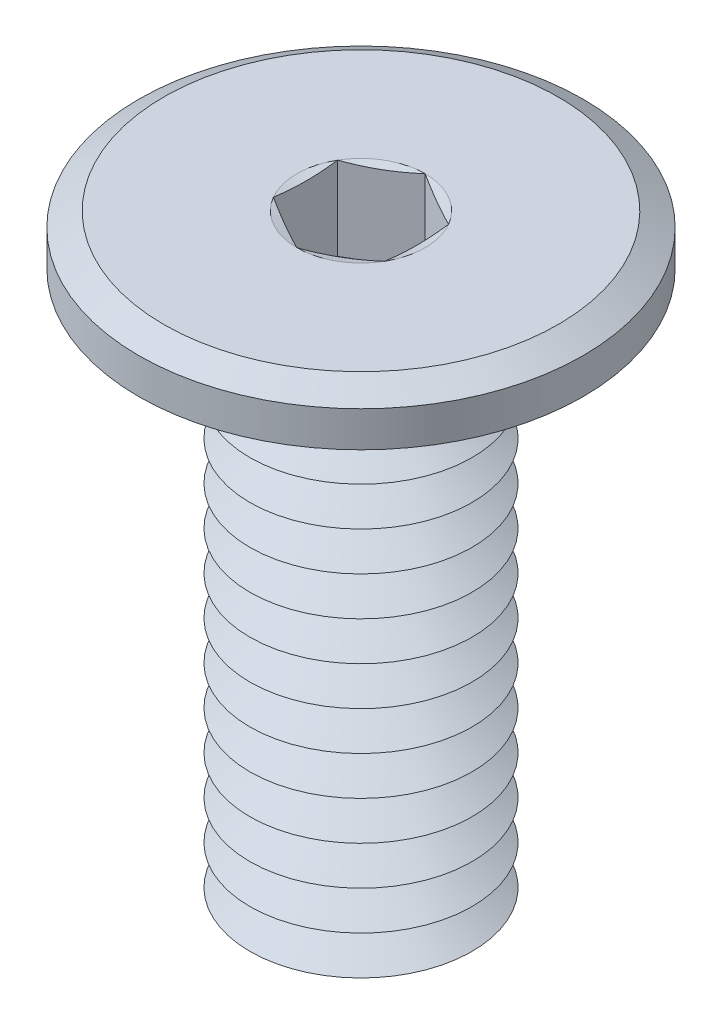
ISO-10303-21;
HEADER;
FILE_DESCRIPTION(('STEP AP214'),'2;1');
FILE_NAME('part.step','',(''),(''),'','','');
FILE_SCHEMA(('AUTOMOTIVE_DESIGN { 1 0 10303 214 1 1 1 1 }'));
ENDSEC;
DATA;
#1=APPLICATION_CONTEXT('core data for automotive mechanical design processes');
#2=APPLICATION_PROTOCOL_DEFINITION('international standard','automotive_design',2000,#1);
#3=PRODUCT_CONTEXT('',#1,'mechanical');
#4=PRODUCT('Part','Part','',(#3));
#5=PRODUCT_RELATED_PRODUCT_CATEGORY('part','',(#4));
#6=PRODUCT_DEFINITION_FORMATION('','',#4);
#7=PRODUCT_DEFINITION_CONTEXT('part definition',#1,'design');
#8=PRODUCT_DEFINITION('design','',#6,#7);
#9=PRODUCT_DEFINITION_SHAPE('','',#8);
#10=(LENGTH_UNIT() NAMED_UNIT(*) SI_UNIT(.MILLI.,.METRE.));
#11=(NAMED_UNIT(*) PLANE_ANGLE_UNIT() SI_UNIT($,.RADIAN.));
#12=(NAMED_UNIT(*) SI_UNIT($,.STERADIAN.) SOLID_ANGLE_UNIT());
#13=UNCERTAINTY_MEASURE_WITH_UNIT(LENGTH_MEASURE(1.E-05),#10,'distance_accuracy_value','');
#14=(GEOMETRIC_REPRESENTATION_CONTEXT(3) GLOBAL_UNCERTAINTY_ASSIGNED_CONTEXT((#13)) GLOBAL_UNIT_ASSIGNED_CONTEXT((#10,
#11,#12)) REPRESENTATION_CONTEXT('',''));
#15=CARTESIAN_POINT('',(0.,0.,0.));
#16=DIRECTION('',(0.,0.,1.));
#17=DIRECTION('',(1.,0.,0.));
#18=AXIS2_PLACEMENT_3D('',#15,#16,#17);
#19=CARTESIAN_POINT('',(0.,-9.85,0.));
#20=DIRECTION('',(0.,-1.,0.));
#21=DIRECTION('',(0.,0.,-1.));
#22=AXIS2_PLACEMENT_3D('',#19,#20,#21);
#23=CONICAL_SURFACE('',#22,2.,1.0471975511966);
#24=CARTESIAN_POINT('',(0.,-9.5,0.));
#25=DIRECTION('',(0.,1.,0.));
#26=DIRECTION('',(0.,0.,1.));
#27=AXIS2_PLACEMENT_3D('',#24,#25,#26);
#28=CIRCLE('',#27,1.39378221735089);
#29=CARTESIAN_POINT('',(0.,-9.5,1.39378221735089));
#30=VERTEX_POINT('',#29);
#31=EDGE_CURVE('E457',#30,#30,#28,.T.);
#32=ORIENTED_EDGE('',*,*,#31,.F.);
#33=EDGE_LOOP('',(#32));
#34=FACE_BOUND('',#33,.T.);
#35=CARTESIAN_POINT('',(0.,-9.85,0.));
#36=DIRECTION('',(0.,1.,0.));
#37=DIRECTION('',(0.,0.,1.));
#38=AXIS2_PLACEMENT_3D('',#35,#36,#37);
#39=CIRCLE('',#38,2.);
#40=CARTESIAN_POINT('',(0.,-9.85,2.));
#41=VERTEX_POINT('',#40);
#42=EDGE_CURVE('E461',#41,#41,#39,.T.);
#43=ORIENTED_EDGE('',*,*,#42,.T.);
#44=EDGE_LOOP('',(#43));
#45=FACE_BOUND('',#44,.T.);
#46=ADVANCED_FACE('F39',(#34,#45),#23,.T.);
#47=CARTESIAN_POINT('',(0.,-9.5,0.));
#48=DIRECTION('',(0.,1.,0.));
#49=DIRECTION('',(0.,0.,1.));
#50=AXIS2_PLACEMENT_3D('',#47,#48,#49);
#51=CONICAL_SURFACE('',#50,1.39378221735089,1.0471975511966);
#52=CARTESIAN_POINT('',(0.,-9.15,0.));
#53=DIRECTION('',(0.,1.,0.));
#54=DIRECTION('',(0.,0.,1.));
#55=AXIS2_PLACEMENT_3D('',#52,#53,#54);
#56=CIRCLE('',#55,2.);
#57=CARTESIAN_POINT('',(0.,-9.15,2.));
#58=VERTEX_POINT('',#57);
#59=EDGE_CURVE('E453',#58,#58,#56,.T.);
#60=ORIENTED_EDGE('',*,*,#59,.F.);
#61=EDGE_LOOP('',(#60));
#62=FACE_BOUND('',#61,.T.);
#63=ORIENTED_EDGE('',*,*,#31,.T.);
#64=EDGE_LOOP('',(#63));
#65=FACE_BOUND('',#64,.T.);
#66=ADVANCED_FACE('F233',(#62,#65),#51,.T.);
#67=CARTESIAN_POINT('',(0.,-10.9,0.));
#68=DIRECTION('',(0.,-1.,0.));
#69=DIRECTION('',(0.,0.,-1.));
#70=AXIS2_PLACEMENT_3D('',#67,#68,#69);
#71=PLANE('',#70);
#72=CARTESIAN_POINT('',(0.,-10.9,0.));
#73=DIRECTION('',(0.,1.,0.));
#74=DIRECTION('',(0.,0.,1.));
#75=AXIS2_PLACEMENT_3D('',#72,#73,#74);
#76=CIRCLE('',#75,1.39378221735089);
#77=CARTESIAN_POINT('',(0.,-10.9,1.39378221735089));
#78=VERTEX_POINT('',#77);
#79=EDGE_CURVE('E300',#78,#78,#76,.T.);
#80=ORIENTED_EDGE('',*,*,#79,.F.);
#81=EDGE_LOOP('',(#80));
#82=FACE_BOUND('',#81,.T.);
#83=ADVANCED_FACE('F239',(#82),#71,.T.);
#84=CARTESIAN_POINT('',(0.,-10.9,0.));
#85=DIRECTION('',(0.,1.,0.));
#86=DIRECTION('',(0.,0.,1.));
#87=AXIS2_PLACEMENT_3D('',#84,#85,#86);
#88=CONICAL_SURFACE('',#87,1.39378221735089,1.0471975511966);
#89=CARTESIAN_POINT('',(0.,-10.55,0.));
#90=DIRECTION('',(0.,1.,0.));
#91=DIRECTION('',(0.,0.,1.));
#92=AXIS2_PLACEMENT_3D('',#89,#90,#91);
#93=CIRCLE('',#92,2.);
#94=CARTESIAN_POINT('',(0.,-10.55,2.));
#95=VERTEX_POINT('',#94);
#96=EDGE_CURVE('E469',#95,#95,#93,.T.);
#97=ORIENTED_EDGE('',*,*,#96,.F.);
#98=EDGE_LOOP('',(#97));
#99=FACE_BOUND('',#98,.T.);
#100=ORIENTED_EDGE('',*,*,#79,.T.);
#101=EDGE_LOOP('',(#100));
#102=FACE_BOUND('',#101,.T.);
#103=ADVANCED_FACE('F254',(#99,#102),#88,.T.);
#104=CARTESIAN_POINT('',(0.,-10.55,0.));
#105=DIRECTION('',(0.,-1.,0.));
#106=DIRECTION('',(0.,0.,-1.));
#107=AXIS2_PLACEMENT_3D('',#104,#105,#106);
#108=CONICAL_SURFACE('',#107,2.,1.0471975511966);
#109=CARTESIAN_POINT('',(0.,-10.2,0.));
#110=DIRECTION('',(0.,1.,0.));
#111=DIRECTION('',(0.,0.,1.));
#112=AXIS2_PLACEMENT_3D('',#109,#110,#111);
#113=CIRCLE('',#112,1.39378221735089);
#114=CARTESIAN_POINT('',(0.,-10.2,1.39378221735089));
#115=VERTEX_POINT('',#114);
#116=EDGE_CURVE('E465',#115,#115,#113,.T.);
#117=ORIENTED_EDGE('',*,*,#116,.F.);
#118=EDGE_LOOP('',(#117));
#119=FACE_BOUND('',#118,.T.);
#120=ORIENTED_EDGE('',*,*,#96,.T.);
#121=EDGE_LOOP('',(#120));
#122=FACE_BOUND('',#121,.T.);
#123=ADVANCED_FACE('F250',(#119,#122),#108,.T.);
#124=CARTESIAN_POINT('',(0.,-10.2,0.));
#125=DIRECTION('',(0.,1.,0.));
#126=DIRECTION('',(0.,0.,1.));
#127=AXIS2_PLACEMENT_3D('',#124,#125,#126);
#128=CONICAL_SURFACE('',#127,1.39378221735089,1.0471975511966);
#129=ORIENTED_EDGE('',*,*,#42,.F.);
#130=EDGE_LOOP('',(#129));
#131=FACE_BOUND('',#130,.T.);
#132=ORIENTED_EDGE('',*,*,#116,.T.);
#133=EDGE_LOOP('',(#132));
#134=FACE_BOUND('',#133,.T.);
#135=ADVANCED_FACE('F246',(#131,#134),#128,.T.);
#136=CARTESIAN_POINT('',(0.,-9.15,0.));
#137=DIRECTION('',(0.,-1.,0.));
#138=DIRECTION('',(0.,0.,-1.));
#139=AXIS2_PLACEMENT_3D('',#136,#137,#138);
#140=CONICAL_SURFACE('',#139,2.,1.0471975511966);
#141=CARTESIAN_POINT('',(0.,-8.8,0.));
#142=DIRECTION('',(0.,1.,0.));
#143=DIRECTION('',(0.,0.,1.));
#144=AXIS2_PLACEMENT_3D('',#141,#142,#143);
#145=CIRCLE('',#144,1.39378221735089);
#146=CARTESIAN_POINT('',(0.,-8.8,1.39378221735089));
#147=VERTEX_POINT('',#146);
#148=EDGE_CURVE('E449',#147,#147,#145,.T.);
#149=ORIENTED_EDGE('',*,*,#148,.F.);
#150=EDGE_LOOP('',(#149));
#151=FACE_BOUND('',#150,.T.);
#152=ORIENTED_EDGE('',*,*,#59,.T.);
#153=EDGE_LOOP('',(#152));
#154=FACE_BOUND('',#153,.T.);
#155=ADVANCED_FACE('F249',(#151,#154),#140,.T.);
#156=CARTESIAN_POINT('',(0.,-8.8,0.));
#157=DIRECTION('',(0.,1.,0.));
#158=DIRECTION('',(0.,0.,1.));
#159=AXIS2_PLACEMENT_3D('',#156,#157,#158);
#160=CONICAL_SURFACE('',#159,1.39378221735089,1.0471975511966);
#161=CARTESIAN_POINT('',(0.,-8.45,0.));
#162=DIRECTION('',(0.,1.,0.));
#163=DIRECTION('',(0.,0.,1.));
#164=AXIS2_PLACEMENT_3D('',#161,#162,#163);
#165=CIRCLE('',#164,2.);
#166=CARTESIAN_POINT('',(0.,-8.45,2.));
#167=VERTEX_POINT('',#166);
#168=EDGE_CURVE('E445',#167,#167,#165,.T.);
#169=ORIENTED_EDGE('',*,*,#168,.F.);
#170=EDGE_LOOP('',(#169));
#171=FACE_BOUND('',#170,.T.);
#172=ORIENTED_EDGE('',*,*,#148,.T.);
#173=EDGE_LOOP('',(#172));
#174=FACE_BOUND('',#173,.T.);
#175=ADVANCED_FACE('F604',(#171,#174),#160,.T.);
#176=CARTESIAN_POINT('',(0.,-8.45,0.));
#177=DIRECTION('',(0.,-1.,0.));
#178=DIRECTION('',(0.,0.,-1.));
#179=AXIS2_PLACEMENT_3D('',#176,#177,#178);
#180=CONICAL_SURFACE('',#179,2.,1.0471975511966);
#181=CARTESIAN_POINT('',(0.,-8.1,0.));
#182=DIRECTION('',(0.,1.,0.));
#183=DIRECTION('',(0.,0.,1.));
#184=AXIS2_PLACEMENT_3D('',#181,#182,#183);
#185=CIRCLE('',#184,1.39378221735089);
#186=CARTESIAN_POINT('',(0.,-8.1,1.39378221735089));
#187=VERTEX_POINT('',#186);
#188=EDGE_CURVE('E441',#187,#187,#185,.T.);
#189=ORIENTED_EDGE('',*,*,#188,.F.);
#190=EDGE_LOOP('',(#189));
#191=FACE_BOUND('',#190,.T.);
#192=ORIENTED_EDGE('',*,*,#168,.T.);
#193=EDGE_LOOP('',(#192));
#194=FACE_BOUND('',#193,.T.);
#195=ADVANCED_FACE('F600',(#191,#194),#180,.T.);
#196=CARTESIAN_POINT('',(0.,-8.1,0.));
#197=DIRECTION('',(0.,1.,0.));
#198=DIRECTION('',(0.,0.,1.));
#199=AXIS2_PLACEMENT_3D('',#196,#197,#198);
#200=CONICAL_SURFACE('',#199,1.39378221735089,1.0471975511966);
#201=CARTESIAN_POINT('',(0.,-7.75,0.));
#202=DIRECTION('',(0.,1.,0.));
#203=DIRECTION('',(0.,0.,1.));
#204=AXIS2_PLACEMENT_3D('',#201,#202,#203);
#205=CIRCLE('',#204,2.);
#206=CARTESIAN_POINT('',(0.,-7.75,2.));
#207=VERTEX_POINT('',#206);
#208=EDGE_CURVE('E437',#207,#207,#205,.T.);
#209=ORIENTED_EDGE('',*,*,#208,.F.);
#210=EDGE_LOOP('',(#209));
#211=FACE_BOUND('',#210,.T.);
#212=ORIENTED_EDGE('',*,*,#188,.T.);
#213=EDGE_LOOP('',(#212));
#214=FACE_BOUND('',#213,.T.);
#215=ADVANCED_FACE('F596',(#211,#214),#200,.T.);
#216=CARTESIAN_POINT('',(0.,-7.75,0.));
#217=DIRECTION('',(0.,-1.,0.));
#218=DIRECTION('',(0.,0.,-1.));
#219=AXIS2_PLACEMENT_3D('',#216,#217,#218);
#220=CONICAL_SURFACE('',#219,2.,1.0471975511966);
#221=CARTESIAN_POINT('',(0.,-7.4,0.));
#222=DIRECTION('',(0.,1.,0.));
#223=DIRECTION('',(0.,0.,1.));
#224=AXIS2_PLACEMENT_3D('',#221,#222,#223);
#225=CIRCLE('',#224,1.39378221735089);
#226=CARTESIAN_POINT('',(0.,-7.4,1.39378221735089));
#227=VERTEX_POINT('',#226);
#228=EDGE_CURVE('E433',#227,#227,#225,.T.);
#229=ORIENTED_EDGE('',*,*,#228,.F.);
#230=EDGE_LOOP('',(#229));
#231=FACE_BOUND('',#230,.T.);
#232=ORIENTED_EDGE('',*,*,#208,.T.);
#233=EDGE_LOOP('',(#232));
#234=FACE_BOUND('',#233,.T.);
#235=ADVANCED_FACE('F592',(#231,#234),#220,.T.);
#236=CARTESIAN_POINT('',(0.,-7.4,0.));
#237=DIRECTION('',(0.,1.,0.));
#238=DIRECTION('',(0.,0.,1.));
#239=AXIS2_PLACEMENT_3D('',#236,#237,#238);
#240=CONICAL_SURFACE('',#239,1.39378221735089,1.0471975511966);
#241=CARTESIAN_POINT('',(0.,-7.05,0.));
#242=DIRECTION('',(0.,1.,0.));
#243=DIRECTION('',(0.,0.,1.));
#244=AXIS2_PLACEMENT_3D('',#241,#242,#243);
#245=CIRCLE('',#244,2.);
#246=CARTESIAN_POINT('',(0.,-7.05,2.));
#247=VERTEX_POINT('',#246);
#248=EDGE_CURVE('E429',#247,#247,#245,.T.);
#249=ORIENTED_EDGE('',*,*,#248,.F.);
#250=EDGE_LOOP('',(#249));
#251=FACE_BOUND('',#250,.T.);
#252=ORIENTED_EDGE('',*,*,#228,.T.);
#253=EDGE_LOOP('',(#252));
#254=FACE_BOUND('',#253,.T.);
#255=ADVANCED_FACE('F588',(#251,#254),#240,.T.);
#256=CARTESIAN_POINT('',(0.,-7.05,0.));
#257=DIRECTION('',(0.,-1.,0.));
#258=DIRECTION('',(0.,0.,-1.));
#259=AXIS2_PLACEMENT_3D('',#256,#257,#258);
#260=CONICAL_SURFACE('',#259,2.,1.0471975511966);
#261=CARTESIAN_POINT('',(0.,-6.7,0.));
#262=DIRECTION('',(0.,1.,0.));
#263=DIRECTION('',(0.,0.,1.));
#264=AXIS2_PLACEMENT_3D('',#261,#262,#263);
#265=CIRCLE('',#264,1.39378221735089);
#266=CARTESIAN_POINT('',(0.,-6.7,1.39378221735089));
#267=VERTEX_POINT('',#266);
#268=EDGE_CURVE('E426',#267,#267,#265,.T.);
#269=ORIENTED_EDGE('',*,*,#268,.F.);
#270=EDGE_LOOP('',(#269));
#271=FACE_BOUND('',#270,.T.);
#272=ORIENTED_EDGE('',*,*,#248,.T.);
#273=EDGE_LOOP('',(#272));
#274=FACE_BOUND('',#273,.T.);
#275=ADVANCED_FACE('F584',(#271,#274),#260,.T.);
#276=CARTESIAN_POINT('',(0.,-6.7,0.));
#277=DIRECTION('',(0.,1.,0.));
#278=DIRECTION('',(0.,0.,1.));
#279=AXIS2_PLACEMENT_3D('',#276,#277,#278);
#280=CONICAL_SURFACE('',#279,1.39378221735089,1.0471975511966);
#281=CARTESIAN_POINT('',(0.,-6.35,0.));
#282=DIRECTION('',(0.,1.,0.));
#283=DIRECTION('',(0.,0.,1.));
#284=AXIS2_PLACEMENT_3D('',#281,#282,#283);
#285=CIRCLE('',#284,2.);
#286=CARTESIAN_POINT('',(0.,-6.35,2.));
#287=VERTEX_POINT('',#286);
#288=EDGE_CURVE('E422',#287,#287,#285,.T.);
#289=ORIENTED_EDGE('',*,*,#288,.F.);
#290=EDGE_LOOP('',(#289));
#291=FACE_BOUND('',#290,.T.);
#292=ORIENTED_EDGE('',*,*,#268,.T.);
#293=EDGE_LOOP('',(#292));
#294=FACE_BOUND('',#293,.T.);
#295=ADVANCED_FACE('F580',(#291,#294),#280,.T.);
#296=CARTESIAN_POINT('',(0.,-6.35,0.));
#297=DIRECTION('',(0.,-1.,0.));
#298=DIRECTION('',(0.,0.,-1.));
#299=AXIS2_PLACEMENT_3D('',#296,#297,#298);
#300=CONICAL_SURFACE('',#299,2.,1.0471975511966);
#301=CARTESIAN_POINT('',(0.,-6.,0.));
#302=DIRECTION('',(0.,1.,0.));
#303=DIRECTION('',(0.,0.,1.));
#304=AXIS2_PLACEMENT_3D('',#301,#302,#303);
#305=CIRCLE('',#304,1.39378221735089);
#306=CARTESIAN_POINT('',(0.,-6.,1.39378221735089));
#307=VERTEX_POINT('',#306);
#308=EDGE_CURVE('E419',#307,#307,#305,.T.);
#309=ORIENTED_EDGE('',*,*,#308,.F.);
#310=EDGE_LOOP('',(#309));
#311=FACE_BOUND('',#310,.T.);
#312=ORIENTED_EDGE('',*,*,#288,.T.);
#313=EDGE_LOOP('',(#312));
#314=FACE_BOUND('',#313,.T.);
#315=ADVANCED_FACE('F576',(#311,#314),#300,.T.);
#316=CARTESIAN_POINT('',(0.,-6.,0.));
#317=DIRECTION('',(0.,1.,0.));
#318=DIRECTION('',(0.,0.,1.));
#319=AXIS2_PLACEMENT_3D('',#316,#317,#318);
#320=CONICAL_SURFACE('',#319,1.39378221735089,1.0471975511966);
#321=CARTESIAN_POINT('',(0.,-5.65,0.));
#322=DIRECTION('',(0.,1.,0.));
#323=DIRECTION('',(0.,0.,1.));
#324=AXIS2_PLACEMENT_3D('',#321,#322,#323);
#325=CIRCLE('',#324,2.);
#326=CARTESIAN_POINT('',(0.,-5.65,2.));
#327=VERTEX_POINT('',#326);
#328=EDGE_CURVE('E416',#327,#327,#325,.T.);
#329=ORIENTED_EDGE('',*,*,#328,.F.);
#330=EDGE_LOOP('',(#329));
#331=FACE_BOUND('',#330,.T.);
#332=ORIENTED_EDGE('',*,*,#308,.T.);
#333=EDGE_LOOP('',(#332));
#334=FACE_BOUND('',#333,.T.);
#335=ADVANCED_FACE('F572',(#331,#334),#320,.T.);
#336=CARTESIAN_POINT('',(0.,-5.65,0.));
#337=DIRECTION('',(0.,-1.,0.));
#338=DIRECTION('',(0.,0.,-1.));
#339=AXIS2_PLACEMENT_3D('',#336,#337,#338);
#340=CONICAL_SURFACE('',#339,2.,1.0471975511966);
#341=CARTESIAN_POINT('',(0.,-5.3,0.));
#342=DIRECTION('',(0.,1.,0.));
#343=DIRECTION('',(0.,0.,1.));
#344=AXIS2_PLACEMENT_3D('',#341,#342,#343);
#345=CIRCLE('',#344,1.39378221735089);
#346=CARTESIAN_POINT('',(0.,-5.3,1.39378221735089));
#347=VERTEX_POINT('',#346);
#348=EDGE_CURVE('E412',#347,#347,#345,.T.);
#349=ORIENTED_EDGE('',*,*,#348,.F.);
#350=EDGE_LOOP('',(#349));
#351=FACE_BOUND('',#350,.T.);
#352=ORIENTED_EDGE('',*,*,#328,.T.);
#353=EDGE_LOOP('',(#352));
#354=FACE_BOUND('',#353,.T.);
#355=ADVANCED_FACE('F568',(#351,#354),#340,.T.);
#356=CARTESIAN_POINT('',(0.,-5.3,0.));
#357=DIRECTION('',(0.,1.,0.));
#358=DIRECTION('',(0.,0.,1.));
#359=AXIS2_PLACEMENT_3D('',#356,#357,#358);
#360=CONICAL_SURFACE('',#359,1.39378221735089,1.0471975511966);
#361=CARTESIAN_POINT('',(0.,-4.95,0.));
#362=DIRECTION('',(0.,1.,0.));
#363=DIRECTION('',(0.,0.,1.));
#364=AXIS2_PLACEMENT_3D('',#361,#362,#363);
#365=CIRCLE('',#364,2.);
#366=CARTESIAN_POINT('',(0.,-4.95,2.));
#367=VERTEX_POINT('',#366);
#368=EDGE_CURVE('E408',#367,#367,#365,.T.);
#369=ORIENTED_EDGE('',*,*,#368,.F.);
#370=EDGE_LOOP('',(#369));
#371=FACE_BOUND('',#370,.T.);
#372=ORIENTED_EDGE('',*,*,#348,.T.);
#373=EDGE_LOOP('',(#372));
#374=FACE_BOUND('',#373,.T.);
#375=ADVANCED_FACE('F564',(#371,#374),#360,.T.);
#376=CARTESIAN_POINT('',(0.,-4.95,0.));
#377=DIRECTION('',(0.,-1.,0.));
#378=DIRECTION('',(0.,0.,-1.));
#379=AXIS2_PLACEMENT_3D('',#376,#377,#378);
#380=CONICAL_SURFACE('',#379,2.,1.0471975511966);
#381=CARTESIAN_POINT('',(0.,-4.6,0.));
#382=DIRECTION('',(0.,1.,0.));
#383=DIRECTION('',(0.,0.,1.));
#384=AXIS2_PLACEMENT_3D('',#381,#382,#383);
#385=CIRCLE('',#384,1.39378221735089);
#386=CARTESIAN_POINT('',(0.,-4.6,1.39378221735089));
#387=VERTEX_POINT('',#386);
#388=EDGE_CURVE('E404',#387,#387,#385,.T.);
#389=ORIENTED_EDGE('',*,*,#388,.F.);
#390=EDGE_LOOP('',(#389));
#391=FACE_BOUND('',#390,.T.);
#392=ORIENTED_EDGE('',*,*,#368,.T.);
#393=EDGE_LOOP('',(#392));
#394=FACE_BOUND('',#393,.T.);
#395=ADVANCED_FACE('F560',(#391,#394),#380,.T.);
#396=CARTESIAN_POINT('',(0.,-4.6,0.));
#397=DIRECTION('',(0.,1.,0.));
#398=DIRECTION('',(0.,0.,1.));
#399=AXIS2_PLACEMENT_3D('',#396,#397,#398);
#400=CONICAL_SURFACE('',#399,1.39378221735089,1.0471975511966);
#401=CARTESIAN_POINT('',(0.,-4.25,0.));
#402=DIRECTION('',(0.,1.,0.));
#403=DIRECTION('',(0.,0.,1.));
#404=AXIS2_PLACEMENT_3D('',#401,#402,#403);
#405=CIRCLE('',#404,2.);
#406=CARTESIAN_POINT('',(0.,-4.25,2.));
#407=VERTEX_POINT('',#406);
#408=EDGE_CURVE('E400',#407,#407,#405,.T.);
#409=ORIENTED_EDGE('',*,*,#408,.F.);
#410=EDGE_LOOP('',(#409));
#411=FACE_BOUND('',#410,.T.);
#412=ORIENTED_EDGE('',*,*,#388,.T.);
#413=EDGE_LOOP('',(#412));
#414=FACE_BOUND('',#413,.T.);
#415=ADVANCED_FACE('F556',(#411,#414),#400,.T.);
#416=CARTESIAN_POINT('',(0.,-4.25,0.));
#417=DIRECTION('',(0.,-1.,0.));
#418=DIRECTION('',(0.,0.,-1.));
#419=AXIS2_PLACEMENT_3D('',#416,#417,#418);
#420=CONICAL_SURFACE('',#419,2.,1.0471975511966);
#421=CARTESIAN_POINT('',(0.,-3.9,0.));
#422=DIRECTION('',(0.,1.,0.));
#423=DIRECTION('',(0.,0.,1.));
#424=AXIS2_PLACEMENT_3D('',#421,#422,#423);
#425=CIRCLE('',#424,1.39378221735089);
#426=CARTESIAN_POINT('',(0.,-3.9,1.39378221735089));
#427=VERTEX_POINT('',#426);
#428=EDGE_CURVE('E396',#427,#427,#425,.T.);
#429=ORIENTED_EDGE('',*,*,#428,.F.);
#430=EDGE_LOOP('',(#429));
#431=FACE_BOUND('',#430,.T.);
#432=ORIENTED_EDGE('',*,*,#408,.T.);
#433=EDGE_LOOP('',(#432));
#434=FACE_BOUND('',#433,.T.);
#435=ADVANCED_FACE('F552',(#431,#434),#420,.T.);
#436=CARTESIAN_POINT('',(0.,-3.9,0.));
#437=DIRECTION('',(0.,1.,0.));
#438=DIRECTION('',(0.,0.,1.));
#439=AXIS2_PLACEMENT_3D('',#436,#437,#438);
#440=CONICAL_SURFACE('',#439,1.39378221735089,1.0471975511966);
#441=CARTESIAN_POINT('',(0.,-3.55,0.));
#442=DIRECTION('',(0.,1.,0.));
#443=DIRECTION('',(0.,0.,1.));
#444=AXIS2_PLACEMENT_3D('',#441,#442,#443);
#445=CIRCLE('',#444,2.);
#446=CARTESIAN_POINT('',(0.,-3.55,2.));
#447=VERTEX_POINT('',#446);
#448=EDGE_CURVE('E392',#447,#447,#445,.T.);
#449=ORIENTED_EDGE('',*,*,#448,.F.);
#450=EDGE_LOOP('',(#449));
#451=FACE_BOUND('',#450,.T.);
#452=ORIENTED_EDGE('',*,*,#428,.T.);
#453=EDGE_LOOP('',(#452));
#454=FACE_BOUND('',#453,.T.);
#455=ADVANCED_FACE('F548',(#451,#454),#440,.T.);
#456=CARTESIAN_POINT('',(0.,-3.55,0.));
#457=DIRECTION('',(0.,-1.,0.));
#458=DIRECTION('',(0.,0.,-1.));
#459=AXIS2_PLACEMENT_3D('',#456,#457,#458);
#460=CONICAL_SURFACE('',#459,2.,1.0471975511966);
#461=CARTESIAN_POINT('',(0.,-3.2,0.));
#462=DIRECTION('',(0.,1.,0.));
#463=DIRECTION('',(0.,0.,1.));
#464=AXIS2_PLACEMENT_3D('',#461,#462,#463);
#465=CIRCLE('',#464,1.39378221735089);
#466=CARTESIAN_POINT('',(0.,-3.2,1.39378221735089));
#467=VERTEX_POINT('',#466);
#468=EDGE_CURVE('E388',#467,#467,#465,.T.);
#469=ORIENTED_EDGE('',*,*,#468,.F.);
#470=EDGE_LOOP('',(#469));
#471=FACE_BOUND('',#470,.T.);
#472=ORIENTED_EDGE('',*,*,#448,.T.);
#473=EDGE_LOOP('',(#472));
#474=FACE_BOUND('',#473,.T.);
#475=ADVANCED_FACE('F544',(#471,#474),#460,.T.);
#476=CARTESIAN_POINT('',(0.,-3.2,0.));
#477=DIRECTION('',(0.,1.,0.));
#478=DIRECTION('',(0.,0.,1.));
#479=AXIS2_PLACEMENT_3D('',#476,#477,#478);
#480=CONICAL_SURFACE('',#479,1.39378221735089,1.0471975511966);
#481=CARTESIAN_POINT('',(0.,-2.85,0.));
#482=DIRECTION('',(0.,1.,0.));
#483=DIRECTION('',(0.,0.,1.));
#484=AXIS2_PLACEMENT_3D('',#481,#482,#483);
#485=CIRCLE('',#484,2.);
#486=CARTESIAN_POINT('',(0.,-2.85,2.));
#487=VERTEX_POINT('',#486);
#488=EDGE_CURVE('E384',#487,#487,#485,.T.);
#489=ORIENTED_EDGE('',*,*,#488,.F.);
#490=EDGE_LOOP('',(#489));
#491=FACE_BOUND('',#490,.T.);
#492=ORIENTED_EDGE('',*,*,#468,.T.);
#493=EDGE_LOOP('',(#492));
#494=FACE_BOUND('',#493,.T.);
#495=ADVANCED_FACE('F540',(#491,#494),#480,.T.);
#496=CARTESIAN_POINT('',(0.,-2.85,0.));
#497=DIRECTION('',(0.,-1.,0.));
#498=DIRECTION('',(0.,0.,-1.));
#499=AXIS2_PLACEMENT_3D('',#496,#497,#498);
#500=CONICAL_SURFACE('',#499,2.,1.0471975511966);
#501=CARTESIAN_POINT('',(0.,-2.5,0.));
#502=DIRECTION('',(0.,1.,0.));
#503=DIRECTION('',(0.,0.,1.));
#504=AXIS2_PLACEMENT_3D('',#501,#502,#503);
#505=CIRCLE('',#504,1.39378221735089);
#506=CARTESIAN_POINT('',(0.,-2.5,1.39378221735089));
#507=VERTEX_POINT('',#506);
#508=EDGE_CURVE('E381',#507,#507,#505,.T.);
#509=ORIENTED_EDGE('',*,*,#508,.F.);
#510=EDGE_LOOP('',(#509));
#511=FACE_BOUND('',#510,.T.);
#512=ORIENTED_EDGE('',*,*,#488,.T.);
#513=EDGE_LOOP('',(#512));
#514=FACE_BOUND('',#513,.T.);
#515=ADVANCED_FACE('F536',(#511,#514),#500,.T.);
#516=CARTESIAN_POINT('',(0.,-2.5,0.));
#517=DIRECTION('',(0.,1.,0.));
#518=DIRECTION('',(0.,0.,1.));
#519=AXIS2_PLACEMENT_3D('',#516,#517,#518);
#520=CONICAL_SURFACE('',#519,1.39378221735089,1.0471975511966);
#521=CARTESIAN_POINT('',(0.,-2.15,0.));
#522=DIRECTION('',(0.,1.,0.));
#523=DIRECTION('',(0.,0.,1.));
#524=AXIS2_PLACEMENT_3D('',#521,#522,#523);
#525=CIRCLE('',#524,2.);
#526=CARTESIAN_POINT('',(0.,-2.15,2.));
#527=VERTEX_POINT('',#526);
#528=EDGE_CURVE('E367',#527,#527,#525,.T.);
#529=ORIENTED_EDGE('',*,*,#528,.F.);
#530=EDGE_LOOP('',(#529));
#531=FACE_BOUND('',#530,.T.);
#532=ORIENTED_EDGE('',*,*,#508,.T.);
#533=EDGE_LOOP('',(#532));
#534=FACE_BOUND('',#533,.T.);
#535=ADVANCED_FACE('F274',(#531,#534),#520,.T.);
#536=CARTESIAN_POINT('',(0.,0.,0.));
#537=DIRECTION('',(0.,1.,0.));
#538=DIRECTION('',(0.,0.,1.));
#539=AXIS2_PLACEMENT_3D('',#536,#537,#538);
#540=PLANE('',#539);
#541=CARTESIAN_POINT('',(0.,0.,0.));
#542=DIRECTION('',(0.,1.,0.));
#543=DIRECTION('',(0.,0.,1.));
#544=AXIS2_PLACEMENT_3D('',#541,#542,#543);
#545=CIRCLE('',#544,1.15470053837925);
#546=CARTESIAN_POINT('',(0.,0.,1.15470053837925));
#547=VERTEX_POINT('',#546);
#548=CARTESIAN_POINT('',(1.,0.,0.577350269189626));
#549=VERTEX_POINT('',#548);
#550=EDGE_CURVE('E66',#547,#549,#545,.T.);
#551=ORIENTED_EDGE('',*,*,#550,.F.);
#552=CARTESIAN_POINT('',(-1.,0.,0.577350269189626));
#553=VERTEX_POINT('',#552);
#554=EDGE_CURVE('E169',#553,#547,#545,.T.);
#555=ORIENTED_EDGE('',*,*,#554,.F.);
#556=CARTESIAN_POINT('',(-1.,0.,-0.577350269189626));
#557=VERTEX_POINT('',#556);
#558=EDGE_CURVE('E164',#557,#553,#545,.T.);
#559=ORIENTED_EDGE('',*,*,#558,.F.);
#560=CARTESIAN_POINT('',(0.,0.,-1.15470053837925));
#561=VERTEX_POINT('',#560);
#562=EDGE_CURVE('E128',#561,#557,#545,.T.);
#563=ORIENTED_EDGE('',*,*,#562,.F.);
#564=CARTESIAN_POINT('',(1.,0.,-0.577350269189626));
#565=VERTEX_POINT('',#564);
#566=EDGE_CURVE('E119',#565,#561,#545,.T.);
#567=ORIENTED_EDGE('',*,*,#566,.F.);
#568=EDGE_CURVE('E59',#549,#565,#545,.T.);
#569=ORIENTED_EDGE('',*,*,#568,.F.);
#570=EDGE_LOOP('',(#551,#555,#559,#563,#567,#569));
#571=FACE_BOUND('',#570,.T.);
#572=CARTESIAN_POINT('',(0.,0.,0.));
#573=DIRECTION('',(0.,1.,0.));
#574=DIRECTION('',(0.,0.,1.));
#575=AXIS2_PLACEMENT_3D('',#572,#573,#574);
#576=CIRCLE('',#575,3.55);
#577=CARTESIAN_POINT('',(0.,0.,3.55));
#578=VERTEX_POINT('',#577);
#579=EDGE_CURVE('E296',#578,#578,#576,.T.);
#580=ORIENTED_EDGE('',*,*,#579,.T.);
#581=EDGE_LOOP('',(#580));
#582=FACE_BOUND('',#581,.T.);
#583=ADVANCED_FACE('F160',(#571,#582),#540,.T.);
#584=CARTESIAN_POINT('',(0.,-0.9,0.));
#585=DIRECTION('',(0.,1.,0.));
#586=DIRECTION('',(0.,0.,1.));
#587=AXIS2_PLACEMENT_3D('',#584,#585,#586);
#588=CYLINDRICAL_SURFACE('',#587,4.);
#589=CARTESIAN_POINT('',(0.,-0.259807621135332,0.));
#590=DIRECTION('',(0.,1.,0.));
#591=DIRECTION('',(0.,0.,1.));
#592=AXIS2_PLACEMENT_3D('',#589,#590,#591);
#593=CIRCLE('',#592,4.);
#594=CARTESIAN_POINT('',(0.,-0.259807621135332,4.));
#595=VERTEX_POINT('',#594);
#596=EDGE_CURVE('E306',#595,#595,#593,.F.);
#597=ORIENTED_EDGE('',*,*,#596,.T.);
#598=EDGE_LOOP('',(#597));
#599=FACE_BOUND('',#598,.T.);
#600=CARTESIAN_POINT('',(0.,-0.9,0.));
#601=DIRECTION('',(0.,1.,0.));
#602=DIRECTION('',(0.,0.,1.));
#603=AXIS2_PLACEMENT_3D('',#600,#601,#602);
#604=CIRCLE('',#603,4.);
#605=CARTESIAN_POINT('',(0.,-0.9,4.));
#606=VERTEX_POINT('',#605);
#607=EDGE_CURVE('E291',#606,#606,#604,.T.);
#608=ORIENTED_EDGE('',*,*,#607,.T.);
#609=EDGE_LOOP('',(#608));
#610=FACE_BOUND('',#609,.T.);
#611=ADVANCED_FACE('F270',(#599,#610),#588,.T.);
#612=CARTESIAN_POINT('',(0.,-0.9,0.));
#613=DIRECTION('',(0.,1.,0.));
#614=DIRECTION('',(0.,0.,1.));
#615=AXIS2_PLACEMENT_3D('',#612,#613,#614);
#616=PLANE('',#615);
#617=CARTESIAN_POINT('',(0.,-0.9,0.));
#618=DIRECTION('',(0.,1.,0.));
#619=DIRECTION('',(0.,0.,1.));
#620=AXIS2_PLACEMENT_3D('',#617,#618,#619);
#621=CIRCLE('',#620,2.2);
#622=CARTESIAN_POINT('',(0.,-0.9,2.2));
#623=VERTEX_POINT('',#622);
#624=EDGE_CURVE('E286',#623,#623,#621,.T.);
#625=ORIENTED_EDGE('',*,*,#624,.T.);
#626=EDGE_LOOP('',(#625));
#627=FACE_BOUND('',#626,.T.);
#628=ORIENTED_EDGE('',*,*,#607,.F.);
#629=EDGE_LOOP('',(#628));
#630=FACE_BOUND('',#629,.T.);
#631=ADVANCED_FACE('F266',(#627,#630),#616,.F.);
#632=CARTESIAN_POINT('',(0.,-10.9,0.));
#633=DIRECTION('',(0.,1.,0.));
#634=DIRECTION('',(0.,0.,1.));
#635=AXIS2_PLACEMENT_3D('',#632,#633,#634);
#636=CYLINDRICAL_SURFACE('',#635,2.);
#637=CARTESIAN_POINT('',(0.,-1.1,0.));
#638=DIRECTION('',(0.,1.,0.));
#639=DIRECTION('',(0.,0.,1.));
#640=AXIS2_PLACEMENT_3D('',#637,#638,#639);
#641=CIRCLE('',#640,2.);
#642=CARTESIAN_POINT('',(0.,-1.1,2.));
#643=VERTEX_POINT('',#642);
#644=EDGE_CURVE('E289',#643,#643,#641,.F.);
#645=ORIENTED_EDGE('',*,*,#644,.T.);
#646=EDGE_LOOP('',(#645));
#647=FACE_BOUND('',#646,.T.);
#648=ORIENTED_EDGE('',*,*,#528,.T.);
#649=EDGE_LOOP('',(#648));
#650=FACE_BOUND('',#649,.T.);
#651=ADVANCED_FACE('F262',(#647,#650),#636,.T.);
#652=CARTESIAN_POINT('',(0.,-1.1,0.));
#653=DIRECTION('',(0.,1.,0.));
#654=DIRECTION('',(0.,0.,1.));
#655=AXIS2_PLACEMENT_3D('',#652,#653,#654);
#656=TOROIDAL_SURFACE('',#655,2.2,0.2);
#657=ORIENTED_EDGE('',*,*,#624,.F.);
#658=EDGE_LOOP('',(#657));
#659=FACE_BOUND('',#658,.T.);
#660=ORIENTED_EDGE('',*,*,#644,.F.);
#661=EDGE_LOOP('',(#660));
#662=FACE_BOUND('',#661,.T.);
#663=ADVANCED_FACE('F265',(#659,#662),#656,.F.);
#664=CARTESIAN_POINT('',(0.,0.,0.));
#665=DIRECTION('',(0.,-1.,0.));
#666=DIRECTION('',(0.,0.,-1.));
#667=AXIS2_PLACEMENT_3D('',#664,#665,#666);
#668=CONICAL_SURFACE('',#667,3.55,1.0471975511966);
#669=ORIENTED_EDGE('',*,*,#596,.F.);
#670=EDGE_LOOP('',(#669));
#671=FACE_BOUND('',#670,.T.);
#672=ORIENTED_EDGE('',*,*,#579,.F.);
#673=EDGE_LOOP('',(#672));
#674=FACE_BOUND('',#673,.T.);
#675=ADVANCED_FACE('F41',(#671,#674),#668,.T.);
#676=CARTESIAN_POINT('',(0.,0.,0.));
#677=DIRECTION('',(0.,1.,0.));
#678=DIRECTION('',(0.,0.,1.));
#679=AXIS2_PLACEMENT_3D('',#676,#677,#678);
#680=CONICAL_SURFACE('',#679,1.15470053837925,1.30899693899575);
#681=ORIENTED_EDGE('',*,*,#562,.T.);
#682=CARTESIAN_POINT('',(0.000200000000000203,3.09447482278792E-05,-1.15481600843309));
#683=CARTESIAN_POINT('',(-0.0413440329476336,-0.00640029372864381,-1.13083054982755));
#684=CARTESIAN_POINT('',(-0.0829634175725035,-0.012238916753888,-1.10680158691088));
#685=CARTESIAN_POINT('',(-0.166349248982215,-0.0224969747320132,-1.05865875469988));
#686=CARTESIAN_POINT('',(-0.208115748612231,-0.0269158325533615,-1.03454485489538));
#687=CARTESIAN_POINT('',(-0.291542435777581,-0.0340762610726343,-0.986378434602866));
#688=CARTESIAN_POINT('',(-0.333202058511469,-0.0368263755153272,-0.962326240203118));
#689=CARTESIAN_POINT('',(-0.416574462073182,-0.0405140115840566,-0.914191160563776));
#690=CARTESIAN_POINT('',(-0.458287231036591,-0.0414518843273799,-0.890108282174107));
#691=CARTESIAN_POINT('',(-0.541712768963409,-0.0414518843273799,-0.84194252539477));
#692=CARTESIAN_POINT('',(-0.583425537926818,-0.0405140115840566,-0.817859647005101));
#693=CARTESIAN_POINT('',(-0.666797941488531,-0.0368263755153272,-0.76972456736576));
#694=CARTESIAN_POINT('',(-0.708457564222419,-0.0340762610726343,-0.745672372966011));
#695=CARTESIAN_POINT('',(-0.791884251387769,-0.0269158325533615,-0.697505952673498));
#696=CARTESIAN_POINT('',(-0.833650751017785,-0.0224969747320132,-0.673392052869));
#697=CARTESIAN_POINT('',(-0.917036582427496,-0.012238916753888,-0.625249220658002));
#698=CARTESIAN_POINT('',(-0.958655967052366,-0.00640029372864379,-0.601220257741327));
#699=CARTESIAN_POINT('',(-1.0002,3.09447482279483E-05,-0.577234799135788));
#700=B_SPLINE_CURVE_WITH_KNOTS('',3,(#682,#683,#684,#685,#686,#687,#688,#689,#690,#691,#692,
#693,#694,#695,#696,#697,#698,#699),.UNSPECIFIED.,.F.,.F.,(4,2,2,2,2,2,2,2,4),(0.,
0.145207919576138,0.290474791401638,0.434991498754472,0.579480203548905,0.723968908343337,
0.868485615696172,1.01375248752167,1.15896040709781),.UNSPECIFIED.);
#701=EDGE_CURVE('E11',#561,#557,#700,.T.);
#702=ORIENTED_EDGE('',*,*,#701,.F.);
#703=EDGE_LOOP('',(#681,#702));
#704=FACE_BOUND('',#703,.T.);
#705=ADVANCED_FACE('F132',(#704),#680,.F.);
#706=ORIENTED_EDGE('',*,*,#558,.T.);
#707=CARTESIAN_POINT('',(-1.,0.236023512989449,-1.77298423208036));
#708=CARTESIAN_POINT('',(-1.,0.216107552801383,-1.6875314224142));
#709=CARTESIAN_POINT('',(-1.,0.196471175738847,-1.60200905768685));
#710=CARTESIAN_POINT('',(-1.,0.158144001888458,-1.43073686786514));
#711=CARTESIAN_POINT('',(-1.,0.139453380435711,-1.34498700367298));
#712=CARTESIAN_POINT('',(-1.,0.1032364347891,-1.17236724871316));
#713=CARTESIAN_POINT('',(-1.,0.0857232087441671,-1.08549457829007));
#714=CARTESIAN_POINT('',(-1.,0.0527507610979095,-0.911344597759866));
#715=CARTESIAN_POINT('',(-1.,0.0372917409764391,-0.824067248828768));
#716=CARTESIAN_POINT('',(-1.,0.00985747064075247,-0.651412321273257));
#717=CARTESIAN_POINT('',(-1.,-0.00220187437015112,-0.566048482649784));
#718=CARTESIAN_POINT('',(-1.,-0.0220616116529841,-0.394830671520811));
#719=CARTESIAN_POINT('',(-1.,-0.0298633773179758,-0.308976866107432));
#720=CARTESIAN_POINT('',(-1.,-0.0398601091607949,-0.137316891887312));
#721=CARTESIAN_POINT('',(-1.,-0.0420806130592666,-0.0515123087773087));
#722=CARTESIAN_POINT('',(-1.,-0.0405086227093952,0.120045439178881));
#723=CARTESIAN_POINT('',(-1.,-0.0367157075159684,0.20579860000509));
#724=CARTESIAN_POINT('',(-1.,-0.0256781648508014,0.353235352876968));
#725=CARTESIAN_POINT('',(-1.,-0.0196775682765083,0.415019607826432));
#726=CARTESIAN_POINT('',(-1.,-0.00545724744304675,0.538326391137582));
#727=CARTESIAN_POINT('',(-1.,0.00276242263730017,0.599848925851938));
#728=CARTESIAN_POINT('',(-1.,0.0300253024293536,0.784439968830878));
#729=CARTESIAN_POINT('',(-1.,0.0516350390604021,0.907124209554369));
#730=CARTESIAN_POINT('',(-1.,0.0871575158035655,1.09186138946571));
#731=CARTESIAN_POINT('',(-1.,0.0996614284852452,1.15420316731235));
#732=CARTESIAN_POINT('',(-1.,0.125434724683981,1.27873123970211));
#733=CARTESIAN_POINT('',(-1.,0.138704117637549,1.34091753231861));
#734=CARTESIAN_POINT('',(-1.,0.165737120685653,1.4648085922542));
#735=CARTESIAN_POINT('',(-1.,0.179497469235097,1.5265140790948));
#736=CARTESIAN_POINT('',(-1.,0.207459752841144,1.64982040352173));
#737=CARTESIAN_POINT('',(-1.,0.221661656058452,1.71142124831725));
#738=CARTESIAN_POINT('',(-1.,0.236023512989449,1.77298423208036));
#739=B_SPLINE_CURVE_WITH_KNOTS('',3,(#707,#708,#709,#710,#711,#712,#713,#714,#715,#716,#717,
#718,#719,#720,#721,#722,#723,#724,#725,#726,#727,#728,#729,#730,#731,#732,#733,#734,#735,#736,
#737,#738),.UNSPECIFIED.,.F.,.F.,(4,2,2,2,2,2,2,2,2,2,2,2,2,2,2,4),(0.,0.263234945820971,
0.52651851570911,0.792363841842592,1.0582352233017,1.31679695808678,1.5752752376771,
1.83256864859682,2.08988007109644,2.27606085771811,2.462237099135,2.83581575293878,
3.02656672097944,3.21732004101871,3.40698211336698,3.59663054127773),.UNSPECIFIED.);
#740=EDGE_CURVE('E172',#557,#553,#739,.T.);
#741=ORIENTED_EDGE('',*,*,#740,.F.);
#742=EDGE_LOOP('',(#706,#741));
#743=FACE_BOUND('',#742,.T.);
#744=ADVANCED_FACE('F704',(#743),#680,.F.);
#745=ORIENTED_EDGE('',*,*,#554,.T.);
#746=CARTESIAN_POINT('',(-1.0002,3.09447482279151E-05,0.577234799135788));
#747=CARTESIAN_POINT('',(-0.958655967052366,-0.00640029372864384,0.601220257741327));
#748=CARTESIAN_POINT('',(-0.917036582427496,-0.012238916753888,0.625249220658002));
#749=CARTESIAN_POINT('',(-0.833650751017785,-0.0224969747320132,0.673392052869));
#750=CARTESIAN_POINT('',(-0.791884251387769,-0.0269158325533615,0.697505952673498));
#751=CARTESIAN_POINT('',(-0.708457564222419,-0.0340762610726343,0.745672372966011));
#752=CARTESIAN_POINT('',(-0.666797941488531,-0.0368263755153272,0.76972456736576));
#753=CARTESIAN_POINT('',(-0.583425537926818,-0.0405140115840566,0.817859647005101));
#754=CARTESIAN_POINT('',(-0.541712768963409,-0.0414518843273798,0.84194252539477));
#755=CARTESIAN_POINT('',(-0.458287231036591,-0.0414518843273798,0.890108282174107));
#756=CARTESIAN_POINT('',(-0.416574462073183,-0.0405140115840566,0.914191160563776));
#757=CARTESIAN_POINT('',(-0.333202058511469,-0.0368263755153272,0.962326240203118));
#758=CARTESIAN_POINT('',(-0.291542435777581,-0.0340762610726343,0.986378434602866));
#759=CARTESIAN_POINT('',(-0.208115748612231,-0.0269158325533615,1.03454485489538));
#760=CARTESIAN_POINT('',(-0.166349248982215,-0.0224969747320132,1.05865875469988));
#761=CARTESIAN_POINT('',(-0.082963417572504,-0.0122389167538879,1.10680158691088));
#762=CARTESIAN_POINT('',(-0.0413440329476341,-0.00640029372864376,1.13083054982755));
#763=CARTESIAN_POINT('',(0.000199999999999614,3.09447482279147E-05,1.15481600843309));
#764=B_SPLINE_CURVE_WITH_KNOTS('',3,(#746,#747,#748,#749,#750,#751,#752,#753,#754,#755,#756,
#757,#758,#759,#760,#761,#762,#763),.UNSPECIFIED.,.F.,.F.,(4,2,2,2,2,2,2,2,4),(0.,
0.145207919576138,0.290474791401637,0.434991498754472,0.579480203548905,0.723968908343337,
0.868485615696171,1.01375248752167,1.15896040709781),.UNSPECIFIED.);
#765=EDGE_CURVE('E180',#553,#547,#764,.T.);
#766=ORIENTED_EDGE('',*,*,#765,.F.);
#767=EDGE_LOOP('',(#745,#766));
#768=FACE_BOUND('',#767,.T.);
#769=ADVANCED_FACE('F711',(#768),#680,.F.);
#770=ORIENTED_EDGE('',*,*,#550,.T.);
#771=CARTESIAN_POINT('',(-0.000200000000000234,3.09447482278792E-05,1.15481600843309));
#772=CARTESIAN_POINT('',(0.0413440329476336,-0.00640029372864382,1.13083054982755));
#773=CARTESIAN_POINT('',(0.0829634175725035,-0.012238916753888,1.10680158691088));
#774=CARTESIAN_POINT('',(0.166349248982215,-0.0224969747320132,1.05865875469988));
#775=CARTESIAN_POINT('',(0.208115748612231,-0.0269158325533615,1.03454485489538));
#776=CARTESIAN_POINT('',(0.291542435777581,-0.0340762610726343,0.986378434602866));
#777=CARTESIAN_POINT('',(0.333202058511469,-0.0368263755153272,0.962326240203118));
#778=CARTESIAN_POINT('',(0.416574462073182,-0.0405140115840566,0.914191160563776));
#779=CARTESIAN_POINT('',(0.458287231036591,-0.0414518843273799,0.890108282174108));
#780=CARTESIAN_POINT('',(0.541712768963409,-0.0414518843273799,0.84194252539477));
#781=CARTESIAN_POINT('',(0.583425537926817,-0.0405140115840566,0.817859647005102));
#782=CARTESIAN_POINT('',(0.666797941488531,-0.0368263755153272,0.76972456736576));
#783=CARTESIAN_POINT('',(0.708457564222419,-0.0340762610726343,0.745672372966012));
#784=CARTESIAN_POINT('',(0.791884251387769,-0.0269158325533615,0.697505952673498));
#785=CARTESIAN_POINT('',(0.833650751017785,-0.0224969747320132,0.673392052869));
#786=CARTESIAN_POINT('',(0.917036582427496,-0.012238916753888,0.625249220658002));
#787=CARTESIAN_POINT('',(0.958655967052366,-0.00640029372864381,0.601220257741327));
#788=CARTESIAN_POINT('',(1.0002,3.09447482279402E-05,0.577234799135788));
#789=B_SPLINE_CURVE_WITH_KNOTS('',3,(#771,#772,#773,#774,#775,#776,#777,#778,#779,#780,#781,
#782,#783,#784,#785,#786,#787,#788),.UNSPECIFIED.,.F.,.F.,(4,2,2,2,2,2,2,2,4),(0.,
0.145207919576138,0.290474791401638,0.434991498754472,0.579480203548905,0.723968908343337,
0.868485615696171,1.01375248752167,1.15896040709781),.UNSPECIFIED.);
#790=EDGE_CURVE('E199',#547,#549,#789,.T.);
#791=ORIENTED_EDGE('',*,*,#790,.F.);
#792=EDGE_LOOP('',(#770,#791));
#793=FACE_BOUND('',#792,.T.);
#794=ADVANCED_FACE('F719',(#793),#680,.F.);
#795=ORIENTED_EDGE('',*,*,#568,.T.);
#796=CARTESIAN_POINT('',(1.,0.23602351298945,1.77298423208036));
#797=CARTESIAN_POINT('',(1.,0.216107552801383,1.6875314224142));
#798=CARTESIAN_POINT('',(1.,0.196471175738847,1.60200905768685));
#799=CARTESIAN_POINT('',(1.,0.158144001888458,1.43073686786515));
#800=CARTESIAN_POINT('',(1.,0.139453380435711,1.34498700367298));
#801=CARTESIAN_POINT('',(1.,0.1032364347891,1.17236724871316));
#802=CARTESIAN_POINT('',(1.,0.0857232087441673,1.08549457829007));
#803=CARTESIAN_POINT('',(1.,0.0527507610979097,0.911344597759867));
#804=CARTESIAN_POINT('',(1.,0.0372917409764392,0.824067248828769));
#805=CARTESIAN_POINT('',(1.,0.00985747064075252,0.651412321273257));
#806=CARTESIAN_POINT('',(1.,-0.00220187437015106,0.566048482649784));
#807=CARTESIAN_POINT('',(1.,-0.0220616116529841,0.394830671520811));
#808=CARTESIAN_POINT('',(1.,-0.0298633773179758,0.308976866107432));
#809=CARTESIAN_POINT('',(1.,-0.0398601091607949,0.137316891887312));
#810=CARTESIAN_POINT('',(1.,-0.0420806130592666,0.051512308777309));
#811=CARTESIAN_POINT('',(1.,-0.0405086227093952,-0.120045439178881));
#812=CARTESIAN_POINT('',(1.,-0.0367157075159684,-0.205798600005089));
#813=CARTESIAN_POINT('',(1.,-0.0256781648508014,-0.353235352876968));
#814=CARTESIAN_POINT('',(1.,-0.0196775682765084,-0.415019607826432));
#815=CARTESIAN_POINT('',(1.,-0.00545724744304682,-0.538326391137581));
#816=CARTESIAN_POINT('',(1.,0.00276242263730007,-0.599848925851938));
#817=CARTESIAN_POINT('',(1.,0.0300253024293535,-0.784439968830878));
#818=CARTESIAN_POINT('',(1.,0.051635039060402,-0.907124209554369));
#819=CARTESIAN_POINT('',(1.,0.0871575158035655,-1.09186138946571));
#820=CARTESIAN_POINT('',(1.,0.0996614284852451,-1.15420316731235));
#821=CARTESIAN_POINT('',(1.,0.125434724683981,-1.27873123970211));
#822=CARTESIAN_POINT('',(1.,0.138704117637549,-1.34091753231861));
#823=CARTESIAN_POINT('',(1.,0.165737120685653,-1.4648085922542));
#824=CARTESIAN_POINT('',(1.,0.179497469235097,-1.5265140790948));
#825=CARTESIAN_POINT('',(1.,0.207459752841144,-1.64982040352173));
#826=CARTESIAN_POINT('',(1.,0.221661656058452,-1.71142124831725));
#827=CARTESIAN_POINT('',(1.,0.236023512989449,-1.77298423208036));
#828=B_SPLINE_CURVE_WITH_KNOTS('',3,(#796,#797,#798,#799,#800,#801,#802,#803,#804,#805,#806,
#807,#808,#809,#810,#811,#812,#813,#814,#815,#816,#817,#818,#819,#820,#821,#822,#823,#824,#825,
#826,#827),.UNSPECIFIED.,.F.,.F.,(4,2,2,2,2,2,2,2,2,2,2,2,2,2,2,4),(0.,0.263234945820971,
0.52651851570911,0.792363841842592,1.0582352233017,1.31679695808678,1.5752752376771,
1.83256864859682,2.08988007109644,2.27606085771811,2.462237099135,2.83581575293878,
3.02656672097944,3.21732004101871,3.40698211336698,3.59663054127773),.UNSPECIFIED.);
#829=EDGE_CURVE('E149',#549,#565,#828,.T.);
#830=ORIENTED_EDGE('',*,*,#829,.F.);
#831=EDGE_LOOP('',(#795,#830));
#832=FACE_BOUND('',#831,.T.);
#833=ADVANCED_FACE('F192',(#832),#680,.F.);
#834=ORIENTED_EDGE('',*,*,#566,.T.);
#835=CARTESIAN_POINT('',(1.0002,3.09447482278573E-05,-0.577234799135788));
#836=CARTESIAN_POINT('',(0.958655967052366,-0.00640029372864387,-0.601220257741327));
#837=CARTESIAN_POINT('',(0.917036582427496,-0.012238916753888,-0.625249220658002));
#838=CARTESIAN_POINT('',(0.833650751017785,-0.0224969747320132,-0.673392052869));
#839=CARTESIAN_POINT('',(0.791884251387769,-0.0269158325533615,-0.697505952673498));
#840=CARTESIAN_POINT('',(0.708457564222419,-0.0340762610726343,-0.745672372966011));
#841=CARTESIAN_POINT('',(0.666797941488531,-0.0368263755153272,-0.76972456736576));
#842=CARTESIAN_POINT('',(0.583425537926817,-0.0405140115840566,-0.817859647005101));
#843=CARTESIAN_POINT('',(0.541712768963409,-0.0414518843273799,-0.84194252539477));
#844=CARTESIAN_POINT('',(0.458287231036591,-0.0414518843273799,-0.890108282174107));
#845=CARTESIAN_POINT('',(0.416574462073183,-0.0405140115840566,-0.914191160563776));
#846=CARTESIAN_POINT('',(0.333202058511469,-0.0368263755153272,-0.962326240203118));
#847=CARTESIAN_POINT('',(0.291542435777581,-0.0340762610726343,-0.986378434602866));
#848=CARTESIAN_POINT('',(0.208115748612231,-0.0269158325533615,-1.03454485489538));
#849=CARTESIAN_POINT('',(0.166349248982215,-0.0224969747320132,-1.05865875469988));
#850=CARTESIAN_POINT('',(0.0829634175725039,-0.012238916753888,-1.10680158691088));
#851=CARTESIAN_POINT('',(0.0413440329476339,-0.00640029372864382,-1.13083054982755));
#852=CARTESIAN_POINT('',(-0.000199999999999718,3.09447482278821E-05,-1.15481600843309));
#853=B_SPLINE_CURVE_WITH_KNOTS('',3,(#835,#836,#837,#838,#839,#840,#841,#842,#843,#844,#845,
#846,#847,#848,#849,#850,#851,#852),.UNSPECIFIED.,.F.,.F.,(4,2,2,2,2,2,2,2,4),(0.,
0.145207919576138,0.290474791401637,0.434991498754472,0.579480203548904,0.723968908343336,
0.868485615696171,1.01375248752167,1.15896040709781),.UNSPECIFIED.);
#854=EDGE_CURVE('E123',#565,#561,#853,.T.);
#855=ORIENTED_EDGE('',*,*,#854,.F.);
#856=EDGE_LOOP('',(#834,#855));
#857=FACE_BOUND('',#856,.T.);
#858=ADVANCED_FACE('F121',(#857),#680,.F.);
#859=CARTESIAN_POINT('',(0.,-1.5,0.));
#860=DIRECTION('',(0.,1.,0.));
#861=DIRECTION('',(0.,0.,1.));
#862=AXIS2_PLACEMENT_3D('',#859,#860,#861);
#863=CONICAL_SURFACE('',#862,1.,1.0471975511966);
#864=CARTESIAN_POINT('',(0.,-2.07735026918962,0.));
#865=VERTEX_POINT('',#864);
#866=VERTEX_LOOP('',#865);
#867=FACE_BOUND('',#866,.T.);
#868=CARTESIAN_POINT('',(0.,-1.5,0.));
#869=DIRECTION('',(0.,1.,0.));
#870=DIRECTION('',(0.,0.,1.));
#871=AXIS2_PLACEMENT_3D('',#868,#869,#870);
#872=CIRCLE('',#871,1.);
#873=CARTESIAN_POINT('',(0.5,-1.5,0.866025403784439));
#874=VERTEX_POINT('',#873);
#875=CARTESIAN_POINT('',(1.,-1.5,0.));
#876=VERTEX_POINT('',#875);
#877=EDGE_CURVE('E148',#874,#876,#872,.T.);
#878=ORIENTED_EDGE('',*,*,#877,.T.);
#879=CARTESIAN_POINT('',(0.,-1.5,0.));
#880=DIRECTION('',(0.,1.,0.));
#881=DIRECTION('',(0.,0.,1.));
#882=AXIS2_PLACEMENT_3D('',#879,#880,#881);
#883=CIRCLE('',#882,1.);
#884=CARTESIAN_POINT('',(0.5,-1.5,-0.866025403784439));
#885=VERTEX_POINT('',#884);
#886=EDGE_CURVE('E53',#876,#885,#883,.T.);
#887=ORIENTED_EDGE('',*,*,#886,.T.);
#888=CARTESIAN_POINT('',(-0.5,-1.5,-0.866025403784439));
#889=VERTEX_POINT('',#888);
#890=EDGE_CURVE('E320',#885,#889,#883,.T.);
#891=ORIENTED_EDGE('',*,*,#890,.T.);
#892=CARTESIAN_POINT('',(-1.,-1.5,0.));
#893=VERTEX_POINT('',#892);
#894=EDGE_CURVE('E318',#889,#893,#883,.T.);
#895=ORIENTED_EDGE('',*,*,#894,.T.);
#896=CARTESIAN_POINT('',(-0.5,-1.5,0.866025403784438));
#897=VERTEX_POINT('',#896);
#898=EDGE_CURVE('E311',#893,#897,#883,.T.);
#899=ORIENTED_EDGE('',*,*,#898,.T.);
#900=EDGE_CURVE('E309',#897,#874,#883,.T.);
#901=ORIENTED_EDGE('',*,*,#900,.T.);
#902=EDGE_LOOP('',(#878,#887,#891,#895,#899,#901));
#903=FACE_BOUND('',#902,.T.);
#904=ADVANCED_FACE('F191',(#867,#903),#863,.F.);
#905=CARTESIAN_POINT('',(0.,-1.5,0.));
#906=DIRECTION('',(0.,1.,0.));
#907=DIRECTION('',(0.,0.,1.));
#908=AXIS2_PLACEMENT_3D('',#905,#906,#907);
#909=PLANE('',#908);
#910=ORIENTED_EDGE('',*,*,#886,.F.);
#911=DIRECTION('',(0.,0.,-1.));
#912=VECTOR('',#911,1.);
#913=CARTESIAN_POINT('',(1.,-1.5,0.577350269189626));
#914=LINE('',#913,#912);
#915=CARTESIAN_POINT('',(1.,-1.5,-0.577350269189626));
#916=VERTEX_POINT('',#915);
#917=EDGE_CURVE('E362',#876,#916,#914,.T.);
#918=ORIENTED_EDGE('',*,*,#917,.T.);
#919=DIRECTION('',(-0.866025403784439,0.,-0.5));
#920=VECTOR('',#919,1.);
#921=CARTESIAN_POINT('',(1.,-1.5,-0.577350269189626));
#922=LINE('',#921,#920);
#923=EDGE_CURVE('E481',#916,#885,#922,.T.);
#924=ORIENTED_EDGE('',*,*,#923,.T.);
#925=EDGE_LOOP('',(#910,#918,#924));
#926=FACE_BOUND('',#925,.T.);
#927=ADVANCED_FACE('F491',(#926),#909,.T.);
#928=ORIENTED_EDGE('',*,*,#877,.F.);
#929=DIRECTION('',(0.866025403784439,0.,-0.5));
#930=VECTOR('',#929,1.);
#931=CARTESIAN_POINT('',(0.,-1.5,1.15470053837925));
#932=LINE('',#931,#930);
#933=CARTESIAN_POINT('',(1.,-1.5,0.577350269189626));
#934=VERTEX_POINT('',#933);
#935=EDGE_CURVE('E357',#874,#934,#932,.T.);
#936=ORIENTED_EDGE('',*,*,#935,.T.);
#937=EDGE_CURVE('E157',#934,#876,#914,.T.);
#938=ORIENTED_EDGE('',*,*,#937,.T.);
#939=EDGE_LOOP('',(#928,#936,#938));
#940=FACE_BOUND('',#939,.T.);
#941=ADVANCED_FACE('F493',(#940),#909,.T.);
#942=ORIENTED_EDGE('',*,*,#900,.F.);
#943=DIRECTION('',(0.866025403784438,0.,0.5));
#944=VECTOR('',#943,1.);
#945=CARTESIAN_POINT('',(-1.,-1.5,0.577350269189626));
#946=LINE('',#945,#944);
#947=CARTESIAN_POINT('',(0.,-1.5,1.15470053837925));
#948=VERTEX_POINT('',#947);
#949=EDGE_CURVE('E349',#897,#948,#946,.T.);
#950=ORIENTED_EDGE('',*,*,#949,.T.);
#951=EDGE_CURVE('E358',#948,#874,#932,.T.);
#952=ORIENTED_EDGE('',*,*,#951,.T.);
#953=EDGE_LOOP('',(#942,#950,#952));
#954=FACE_BOUND('',#953,.T.);
#955=ADVANCED_FACE('F220',(#954),#909,.T.);
#956=ORIENTED_EDGE('',*,*,#898,.F.);
#957=DIRECTION('',(0.,0.,1.));
#958=VECTOR('',#957,1.);
#959=CARTESIAN_POINT('',(-1.,-1.5,-0.577350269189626));
#960=LINE('',#959,#958);
#961=CARTESIAN_POINT('',(-1.,-1.5,0.577350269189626));
#962=VERTEX_POINT('',#961);
#963=EDGE_CURVE('E338',#893,#962,#960,.T.);
#964=ORIENTED_EDGE('',*,*,#963,.T.);
#965=EDGE_CURVE('E341',#962,#897,#946,.T.);
#966=ORIENTED_EDGE('',*,*,#965,.T.);
#967=EDGE_LOOP('',(#956,#964,#966));
#968=FACE_BOUND('',#967,.T.);
#969=ADVANCED_FACE('F337',(#968),#909,.T.);
#970=ORIENTED_EDGE('',*,*,#890,.F.);
#971=CARTESIAN_POINT('',(0.,-1.5,-1.15470053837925));
#972=VERTEX_POINT('',#971);
#973=EDGE_CURVE('E484',#885,#972,#922,.T.);
#974=ORIENTED_EDGE('',*,*,#973,.T.);
#975=DIRECTION('',(-0.866025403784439,0.,0.5));
#976=VECTOR('',#975,1.);
#977=CARTESIAN_POINT('',(0.,-1.5,-1.15470053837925));
#978=LINE('',#977,#976);
#979=EDGE_CURVE('E154',#972,#889,#978,.T.);
#980=ORIENTED_EDGE('',*,*,#979,.T.);
#981=EDGE_LOOP('',(#970,#974,#980));
#982=FACE_BOUND('',#981,.T.);
#983=ADVANCED_FACE('F512',(#982),#909,.T.);
#984=ORIENTED_EDGE('',*,*,#894,.F.);
#985=CARTESIAN_POINT('',(-1.,-1.5,-0.577350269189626));
#986=VERTEX_POINT('',#985);
#987=EDGE_CURVE('E347',#889,#986,#978,.T.);
#988=ORIENTED_EDGE('',*,*,#987,.T.);
#989=EDGE_CURVE('E343',#986,#893,#960,.T.);
#990=ORIENTED_EDGE('',*,*,#989,.T.);
#991=EDGE_LOOP('',(#984,#988,#990));
#992=FACE_BOUND('',#991,.T.);
#993=ADVANCED_FACE('F346',(#992),#909,.T.);
#994=CARTESIAN_POINT('',(0.,-1.5,-1.15470053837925));
#995=DIRECTION('',(-0.5,0.,-0.866025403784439));
#996=DIRECTION('',(-0.866025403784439,0.,0.5));
#997=AXIS2_PLACEMENT_3D('',#994,#995,#996);
#998=PLANE('',#997);
#999=DIRECTION('',(0.,1.,0.));
#1000=VECTOR('',#999,1.);
#1001=CARTESIAN_POINT('',(0.,-1.5,-1.15470053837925));
#1002=LINE('',#1001,#1000);
#1003=EDGE_CURVE('E142',#972,#561,#1002,.T.);
#1004=ORIENTED_EDGE('',*,*,#1003,.T.);
#1005=ORIENTED_EDGE('',*,*,#701,.T.);
#1006=DIRECTION('',(0.,1.,0.));
#1007=VECTOR('',#1006,1.);
#1008=CARTESIAN_POINT('',(-1.,-1.5,-0.577350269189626));
#1009=LINE('',#1008,#1007);
#1010=EDGE_CURVE('E156',#986,#557,#1009,.T.);
#1011=ORIENTED_EDGE('',*,*,#1010,.F.);
#1012=ORIENTED_EDGE('',*,*,#987,.F.);
#1013=ORIENTED_EDGE('',*,*,#979,.F.);
#1014=EDGE_LOOP('',(#1004,#1005,#1011,#1012,#1013));
#1015=FACE_BOUND('',#1014,.T.);
#1016=ADVANCED_FACE('F151',(#1015),#998,.F.);
#1017=CARTESIAN_POINT('',(-1.,-1.5,-0.577350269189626));
#1018=DIRECTION('',(-1.,0.,0.));
#1019=DIRECTION('',(0.,0.,1.));
#1020=AXIS2_PLACEMENT_3D('',#1017,#1018,#1019);
#1021=PLANE('',#1020);
#1022=ORIENTED_EDGE('',*,*,#1010,.T.);
#1023=ORIENTED_EDGE('',*,*,#740,.T.);
#1024=DIRECTION('',(0.,1.,0.));
#1025=VECTOR('',#1024,1.);
#1026=CARTESIAN_POINT('',(-1.,-1.5,0.577350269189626));
#1027=LINE('',#1026,#1025);
#1028=EDGE_CURVE('E344',#962,#553,#1027,.T.);
#1029=ORIENTED_EDGE('',*,*,#1028,.F.);
#1030=ORIENTED_EDGE('',*,*,#963,.F.);
#1031=ORIENTED_EDGE('',*,*,#989,.F.);
#1032=EDGE_LOOP('',(#1022,#1023,#1029,#1030,#1031));
#1033=FACE_BOUND('',#1032,.T.);
#1034=ADVANCED_FACE('F186',(#1033),#1021,.F.);
#1035=CARTESIAN_POINT('',(-1.,-1.5,0.577350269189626));
#1036=DIRECTION('',(-0.5,0.,0.866025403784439));
#1037=DIRECTION('',(0.866025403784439,0.,0.5));
#1038=AXIS2_PLACEMENT_3D('',#1035,#1036,#1037);
#1039=PLANE('',#1038);
#1040=ORIENTED_EDGE('',*,*,#1028,.T.);
#1041=ORIENTED_EDGE('',*,*,#765,.T.);
#1042=DIRECTION('',(0.,1.,0.));
#1043=VECTOR('',#1042,1.);
#1044=CARTESIAN_POINT('',(0.,-1.5,1.15470053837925));
#1045=LINE('',#1044,#1043);
#1046=EDGE_CURVE('E372',#948,#547,#1045,.T.);
#1047=ORIENTED_EDGE('',*,*,#1046,.F.);
#1048=ORIENTED_EDGE('',*,*,#949,.F.);
#1049=ORIENTED_EDGE('',*,*,#965,.F.);
#1050=EDGE_LOOP('',(#1040,#1041,#1047,#1048,#1049));
#1051=FACE_BOUND('',#1050,.T.);
#1052=ADVANCED_FACE('F223',(#1051),#1039,.F.);
#1053=CARTESIAN_POINT('',(0.,-1.5,1.15470053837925));
#1054=DIRECTION('',(0.5,0.,0.866025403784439));
#1055=DIRECTION('',(0.866025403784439,0.,-0.5));
#1056=AXIS2_PLACEMENT_3D('',#1053,#1054,#1055);
#1057=PLANE('',#1056);
#1058=ORIENTED_EDGE('',*,*,#1046,.T.);
#1059=ORIENTED_EDGE('',*,*,#790,.T.);
#1060=DIRECTION('',(0.,1.,0.));
#1061=VECTOR('',#1060,1.);
#1062=CARTESIAN_POINT('',(1.,-1.5,0.577350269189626));
#1063=LINE('',#1062,#1061);
#1064=EDGE_CURVE('E368',#934,#549,#1063,.T.);
#1065=ORIENTED_EDGE('',*,*,#1064,.F.);
#1066=ORIENTED_EDGE('',*,*,#935,.F.);
#1067=ORIENTED_EDGE('',*,*,#951,.F.);
#1068=EDGE_LOOP('',(#1058,#1059,#1065,#1066,#1067));
#1069=FACE_BOUND('',#1068,.T.);
#1070=ADVANCED_FACE('F218',(#1069),#1057,.F.);
#1071=CARTESIAN_POINT('',(1.,-1.5,0.577350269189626));
#1072=DIRECTION('',(1.,0.,0.));
#1073=DIRECTION('',(0.,0.,-1.));
#1074=AXIS2_PLACEMENT_3D('',#1071,#1072,#1073);
#1075=PLANE('',#1074);
#1076=ORIENTED_EDGE('',*,*,#1064,.T.);
#1077=ORIENTED_EDGE('',*,*,#829,.T.);
#1078=DIRECTION('',(0.,1.,0.));
#1079=VECTOR('',#1078,1.);
#1080=CARTESIAN_POINT('',(1.,-1.5,-0.577350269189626));
#1081=LINE('',#1080,#1079);
#1082=EDGE_CURVE('E146',#916,#565,#1081,.T.);
#1083=ORIENTED_EDGE('',*,*,#1082,.F.);
#1084=ORIENTED_EDGE('',*,*,#917,.F.);
#1085=ORIENTED_EDGE('',*,*,#937,.F.);
#1086=EDGE_LOOP('',(#1076,#1077,#1083,#1084,#1085));
#1087=FACE_BOUND('',#1086,.T.);
#1088=ADVANCED_FACE('F215',(#1087),#1075,.F.);
#1089=CARTESIAN_POINT('',(1.,-1.5,-0.577350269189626));
#1090=DIRECTION('',(0.5,0.,-0.866025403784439));
#1091=DIRECTION('',(-0.866025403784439,0.,-0.5));
#1092=AXIS2_PLACEMENT_3D('',#1089,#1090,#1091);
#1093=PLANE('',#1092);
#1094=ORIENTED_EDGE('',*,*,#1082,.T.);
#1095=ORIENTED_EDGE('',*,*,#854,.T.);
#1096=ORIENTED_EDGE('',*,*,#1003,.F.);
#1097=ORIENTED_EDGE('',*,*,#973,.F.);
#1098=ORIENTED_EDGE('',*,*,#923,.F.);
#1099=EDGE_LOOP('',(#1094,#1095,#1096,#1097,#1098));
#1100=FACE_BOUND('',#1099,.T.);
#1101=ADVANCED_FACE('F140',(#1100),#1093,.F.);
#1102=CLOSED_SHELL('',(#46,#66,#83,#103,#123,#135,#155,#175,#195,#215,#235,#255,#275,#295,#315,
#335,#355,#375,#395,#415,#435,#455,#475,#495,#515,#535,#583,#611,#631,#651,#663,#675,#705,#744,
#769,#794,#833,#858,#904,#927,#941,#955,#969,#983,#993,#1016,#1034,#1052,#1070,#1088,#1101));
#1103=MANIFOLD_SOLID_BREP('B2',#1102);
#1104=ADVANCED_BREP_SHAPE_REPRESENTATION('',(#18,#1103),#14);
#1105=SHAPE_DEFINITION_REPRESENTATION(#9,#1104);
ENDSEC;
END-ISO-10303-21;
